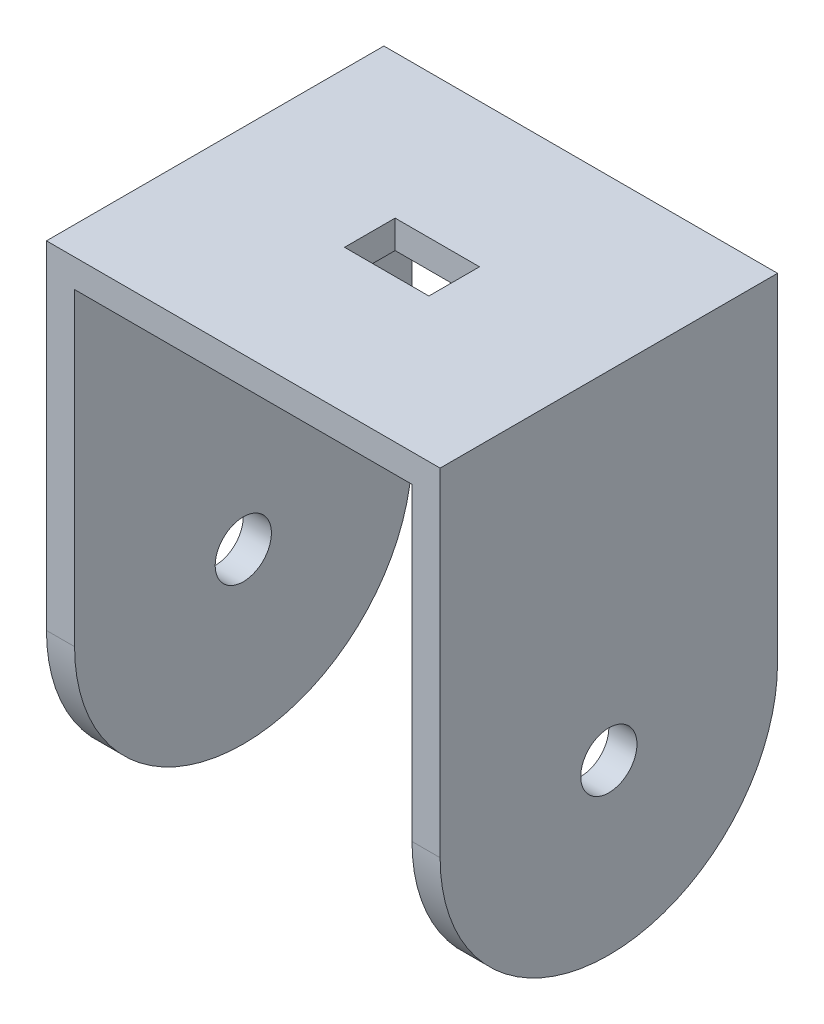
ISO-10303-21;
HEADER;
FILE_DESCRIPTION(('STEP AP214'),'2;1');
FILE_NAME('part.step','',(''),(''),'','','');
FILE_SCHEMA(('AUTOMOTIVE_DESIGN { 1 0 10303 214 1 1 1 1 }'));
ENDSEC;
DATA;
#1=APPLICATION_CONTEXT('core data for automotive mechanical design processes');
#2=APPLICATION_PROTOCOL_DEFINITION('international standard','automotive_design',2000,#1);
#3=PRODUCT_CONTEXT('',#1,'mechanical');
#4=PRODUCT('Part','Part','',(#3));
#5=PRODUCT_RELATED_PRODUCT_CATEGORY('part','',(#4));
#6=PRODUCT_DEFINITION_FORMATION('','',#4);
#7=PRODUCT_DEFINITION_CONTEXT('part definition',#1,'design');
#8=PRODUCT_DEFINITION('design','',#6,#7);
#9=PRODUCT_DEFINITION_SHAPE('','',#8);
#10=(LENGTH_UNIT() NAMED_UNIT(*) SI_UNIT(.MILLI.,.METRE.));
#11=(NAMED_UNIT(*) PLANE_ANGLE_UNIT() SI_UNIT($,.RADIAN.));
#12=(NAMED_UNIT(*) SI_UNIT($,.STERADIAN.) SOLID_ANGLE_UNIT());
#13=UNCERTAINTY_MEASURE_WITH_UNIT(LENGTH_MEASURE(1.E-05),#10,'distance_accuracy_value','');
#14=(GEOMETRIC_REPRESENTATION_CONTEXT(3) GLOBAL_UNCERTAINTY_ASSIGNED_CONTEXT((#13)) GLOBAL_UNIT_ASSIGNED_CONTEXT((#10,
#11,#12)) REPRESENTATION_CONTEXT('',''));
#15=CARTESIAN_POINT('',(0.,0.,0.));
#16=DIRECTION('',(0.,0.,1.));
#17=DIRECTION('',(1.,0.,0.));
#18=AXIS2_PLACEMENT_3D('',#15,#16,#17);
#19=CARTESIAN_POINT('',(0.,-5.,0.));
#20=DIRECTION('',(0.,1.,0.));
#21=DIRECTION('',(0.,0.,1.));
#22=AXIS2_PLACEMENT_3D('',#19,#20,#21);
#23=PLANE('',#22);
#24=DIRECTION('',(1.,0.,0.));
#25=VECTOR('',#24,1.);
#26=CARTESIAN_POINT('',(0.,-5.,4.5));
#27=LINE('',#26,#25);
#28=CARTESIAN_POINT('',(-7.5,-5.,4.5));
#29=VERTEX_POINT('',#28);
#30=CARTESIAN_POINT('',(7.5,-5.,4.5));
#31=VERTEX_POINT('',#30);
#32=EDGE_CURVE('E155',#29,#31,#27,.T.);
#33=ORIENTED_EDGE('',*,*,#32,.T.);
#34=DIRECTION('',(0.,0.,-1.));
#35=VECTOR('',#34,1.);
#36=CARTESIAN_POINT('',(7.5,-5.,0.));
#37=LINE('',#36,#35);
#38=CARTESIAN_POINT('',(7.5,-5.,-4.5));
#39=VERTEX_POINT('',#38);
#40=EDGE_CURVE('E158',#31,#39,#37,.T.);
#41=ORIENTED_EDGE('',*,*,#40,.T.);
#42=DIRECTION('',(-1.,0.,0.));
#43=VECTOR('',#42,1.);
#44=CARTESIAN_POINT('',(0.,-5.,-4.5));
#45=LINE('',#44,#43);
#46=CARTESIAN_POINT('',(-7.5,-5.,-4.5));
#47=VERTEX_POINT('',#46);
#48=EDGE_CURVE('E150',#39,#47,#45,.T.);
#49=ORIENTED_EDGE('',*,*,#48,.T.);
#50=DIRECTION('',(0.,0.,1.));
#51=VECTOR('',#50,1.);
#52=CARTESIAN_POINT('',(-7.5,-5.,0.));
#53=LINE('',#52,#51);
#54=EDGE_CURVE('E130',#47,#29,#53,.T.);
#55=ORIENTED_EDGE('',*,*,#54,.T.);
#56=EDGE_LOOP('',(#33,#41,#49,#55));
#57=FACE_BOUND('',#56,.T.);
#58=DIRECTION('',(0.,0.,1.));
#59=VECTOR('',#58,1.);
#60=CARTESIAN_POINT('',(-30.,-5.,0.));
#61=LINE('',#60,#59);
#62=CARTESIAN_POINT('',(-30.,-5.,-30.));
#63=VERTEX_POINT('',#62);
#64=CARTESIAN_POINT('',(-30.,-5.,30.));
#65=VERTEX_POINT('',#64);
#66=EDGE_CURVE('E183',#63,#65,#61,.T.);
#67=ORIENTED_EDGE('',*,*,#66,.F.);
#68=DIRECTION('',(-1.,0.,0.));
#69=VECTOR('',#68,1.);
#70=CARTESIAN_POINT('',(-35.,-5.,-30.));
#71=LINE('',#70,#69);
#72=CARTESIAN_POINT('',(30.,-5.,-30.));
#73=VERTEX_POINT('',#72);
#74=EDGE_CURVE('E207',#73,#63,#71,.T.);
#75=ORIENTED_EDGE('',*,*,#74,.F.);
#76=DIRECTION('',(0.,0.,-1.));
#77=VECTOR('',#76,1.);
#78=CARTESIAN_POINT('',(30.,-5.,0.));
#79=LINE('',#78,#77);
#80=CARTESIAN_POINT('',(30.,-5.,30.));
#81=VERTEX_POINT('',#80);
#82=EDGE_CURVE('E202',#81,#73,#79,.T.);
#83=ORIENTED_EDGE('',*,*,#82,.F.);
#84=DIRECTION('',(1.,0.,0.));
#85=VECTOR('',#84,1.);
#86=CARTESIAN_POINT('',(-35.,-5.,30.));
#87=LINE('',#86,#85);
#88=EDGE_CURVE('E210',#65,#81,#87,.T.);
#89=ORIENTED_EDGE('',*,*,#88,.F.);
#90=EDGE_LOOP('',(#67,#75,#83,#89));
#91=FACE_BOUND('',#90,.T.);
#92=ADVANCED_FACE('F33',(#57,#91),#23,.F.);
#93=CARTESIAN_POINT('',(35.,-5.,-30.));
#94=DIRECTION('',(1.,0.,0.));
#95=DIRECTION('',(0.,0.,-1.));
#96=AXIS2_PLACEMENT_3D('',#93,#94,#95);
#97=PLANE('',#96);
#98=CARTESIAN_POINT('',(35.,-60.,0.));
#99=DIRECTION('',(1.,0.,0.));
#100=DIRECTION('',(0.,0.,-1.));
#101=AXIS2_PLACEMENT_3D('',#98,#99,#100);
#102=CIRCLE('',#101,5.);
#103=CARTESIAN_POINT('',(35.,-60.,-5.00000000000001));
#104=VERTEX_POINT('',#103);
#105=EDGE_CURVE('E161',#104,#104,#102,.T.);
#106=ORIENTED_EDGE('',*,*,#105,.F.);
#107=EDGE_LOOP('',(#106));
#108=FACE_BOUND('',#107,.T.);
#109=DIRECTION('',(0.,0.,-1.));
#110=VECTOR('',#109,1.);
#111=CARTESIAN_POINT('',(35.,0.,-30.));
#112=LINE('',#111,#110);
#113=CARTESIAN_POINT('',(35.,0.,30.));
#114=VERTEX_POINT('',#113);
#115=CARTESIAN_POINT('',(35.,0.,-30.));
#116=VERTEX_POINT('',#115);
#117=EDGE_CURVE('E206',#114,#116,#112,.T.);
#118=ORIENTED_EDGE('',*,*,#117,.F.);
#119=DIRECTION('',(0.,1.,0.));
#120=VECTOR('',#119,1.);
#121=CARTESIAN_POINT('',(35.,-5.,30.));
#122=LINE('',#121,#120);
#123=CARTESIAN_POINT('',(35.,-60.,30.));
#124=VERTEX_POINT('',#123);
#125=EDGE_CURVE('E11',#124,#114,#122,.T.);
#126=ORIENTED_EDGE('',*,*,#125,.F.);
#127=CARTESIAN_POINT('',(35.,-60.,0.));
#128=DIRECTION('',(1.,0.,0.));
#129=DIRECTION('',(0.,0.,-1.));
#130=AXIS2_PLACEMENT_3D('',#127,#128,#129);
#131=CIRCLE('',#130,30.);
#132=CARTESIAN_POINT('',(35.,-60.,-30.));
#133=VERTEX_POINT('',#132);
#134=EDGE_CURVE('E187',#124,#133,#131,.T.);
#135=ORIENTED_EDGE('',*,*,#134,.T.);
#136=DIRECTION('',(0.,1.,0.));
#137=VECTOR('',#136,1.);
#138=CARTESIAN_POINT('',(35.,-5.,-30.));
#139=LINE('',#138,#137);
#140=EDGE_CURVE('E213',#133,#116,#139,.T.);
#141=ORIENTED_EDGE('',*,*,#140,.T.);
#142=EDGE_LOOP('',(#118,#126,#135,#141));
#143=FACE_BOUND('',#142,.T.);
#144=ADVANCED_FACE('F35',(#108,#143),#97,.T.);
#145=CARTESIAN_POINT('',(-35.,-5.,30.));
#146=DIRECTION('',(0.,0.,1.));
#147=DIRECTION('',(1.,0.,0.));
#148=AXIS2_PLACEMENT_3D('',#145,#146,#147);
#149=PLANE('',#148);
#150=DIRECTION('',(0.,1.,0.));
#151=VECTOR('',#150,1.);
#152=CARTESIAN_POINT('',(-35.,-5.,30.));
#153=LINE('',#152,#151);
#154=CARTESIAN_POINT('',(-35.,-60.,30.));
#155=VERTEX_POINT('',#154);
#156=CARTESIAN_POINT('',(-35.,0.,30.));
#157=VERTEX_POINT('',#156);
#158=EDGE_CURVE('E42',#155,#157,#153,.T.);
#159=ORIENTED_EDGE('',*,*,#158,.F.);
#160=DIRECTION('',(-1.,0.,0.));
#161=VECTOR('',#160,1.);
#162=CARTESIAN_POINT('',(-30.,-60.,30.));
#163=LINE('',#162,#161);
#164=CARTESIAN_POINT('',(-30.,-60.,30.));
#165=VERTEX_POINT('',#164);
#166=EDGE_CURVE('E180',#165,#155,#163,.T.);
#167=ORIENTED_EDGE('',*,*,#166,.F.);
#168=DIRECTION('',(0.,-1.,0.));
#169=VECTOR('',#168,1.);
#170=CARTESIAN_POINT('',(-30.,0.,30.));
#171=LINE('',#170,#169);
#172=EDGE_CURVE('E175',#65,#165,#171,.T.);
#173=ORIENTED_EDGE('',*,*,#172,.F.);
#174=ORIENTED_EDGE('',*,*,#88,.T.);
#175=DIRECTION('',(0.,-1.,0.));
#176=VECTOR('',#175,1.);
#177=CARTESIAN_POINT('',(30.,0.,30.));
#178=LINE('',#177,#176);
#179=CARTESIAN_POINT('',(30.,-60.,30.));
#180=VERTEX_POINT('',#179);
#181=EDGE_CURVE('E188',#81,#180,#178,.T.);
#182=ORIENTED_EDGE('',*,*,#181,.T.);
#183=DIRECTION('',(1.,0.,0.));
#184=VECTOR('',#183,1.);
#185=CARTESIAN_POINT('',(30.,-60.,30.));
#186=LINE('',#185,#184);
#187=EDGE_CURVE('E196',#180,#124,#186,.T.);
#188=ORIENTED_EDGE('',*,*,#187,.T.);
#189=ORIENTED_EDGE('',*,*,#125,.T.);
#190=DIRECTION('',(1.,0.,0.));
#191=VECTOR('',#190,1.);
#192=CARTESIAN_POINT('',(-35.,0.,30.));
#193=LINE('',#192,#191);
#194=EDGE_CURVE('E211',#157,#114,#193,.T.);
#195=ORIENTED_EDGE('',*,*,#194,.F.);
#196=EDGE_LOOP('',(#159,#167,#173,#174,#182,#188,#189,#195));
#197=FACE_BOUND('',#196,.T.);
#198=ADVANCED_FACE('F234',(#197),#149,.T.);
#199=CARTESIAN_POINT('',(-35.,-5.,-30.));
#200=DIRECTION('',(-1.,0.,0.));
#201=DIRECTION('',(0.,0.,1.));
#202=AXIS2_PLACEMENT_3D('',#199,#200,#201);
#203=PLANE('',#202);
#204=CARTESIAN_POINT('',(-35.,-60.,0.));
#205=DIRECTION('',(1.,0.,0.));
#206=DIRECTION('',(0.,0.,-1.));
#207=AXIS2_PLACEMENT_3D('',#204,#205,#206);
#208=CIRCLE('',#207,5.);
#209=CARTESIAN_POINT('',(-35.,-60.,-4.99999999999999));
#210=VERTEX_POINT('',#209);
#211=EDGE_CURVE('E162',#210,#210,#208,.T.);
#212=ORIENTED_EDGE('',*,*,#211,.T.);
#213=EDGE_LOOP('',(#212));
#214=FACE_BOUND('',#213,.T.);
#215=DIRECTION('',(0.,0.,1.));
#216=VECTOR('',#215,1.);
#217=CARTESIAN_POINT('',(-35.,0.,-30.));
#218=LINE('',#217,#216);
#219=CARTESIAN_POINT('',(-35.,0.,-30.));
#220=VERTEX_POINT('',#219);
#221=EDGE_CURVE('E218',#220,#157,#218,.T.);
#222=ORIENTED_EDGE('',*,*,#221,.F.);
#223=DIRECTION('',(0.,1.,0.));
#224=VECTOR('',#223,1.);
#225=CARTESIAN_POINT('',(-35.,-5.,-30.));
#226=LINE('',#225,#224);
#227=CARTESIAN_POINT('',(-35.,-60.,-30.));
#228=VERTEX_POINT('',#227);
#229=EDGE_CURVE('E223',#228,#220,#226,.T.);
#230=ORIENTED_EDGE('',*,*,#229,.F.);
#231=CARTESIAN_POINT('',(-35.,-60.,0.));
#232=DIRECTION('',(1.,0.,0.));
#233=DIRECTION('',(0.,0.,-1.));
#234=AXIS2_PLACEMENT_3D('',#231,#232,#233);
#235=CIRCLE('',#234,30.);
#236=EDGE_CURVE('E170',#155,#228,#235,.T.);
#237=ORIENTED_EDGE('',*,*,#236,.F.);
#238=ORIENTED_EDGE('',*,*,#158,.T.);
#239=EDGE_LOOP('',(#222,#230,#237,#238));
#240=FACE_BOUND('',#239,.T.);
#241=ADVANCED_FACE('F258',(#214,#240),#203,.T.);
#242=CARTESIAN_POINT('',(-35.,-5.,-30.));
#243=DIRECTION('',(0.,0.,-1.));
#244=DIRECTION('',(-1.,0.,0.));
#245=AXIS2_PLACEMENT_3D('',#242,#243,#244);
#246=PLANE('',#245);
#247=ORIENTED_EDGE('',*,*,#229,.T.);
#248=DIRECTION('',(-1.,0.,0.));
#249=VECTOR('',#248,1.);
#250=CARTESIAN_POINT('',(-35.,0.,-30.));
#251=LINE('',#250,#249);
#252=EDGE_CURVE('E216',#116,#220,#251,.T.);
#253=ORIENTED_EDGE('',*,*,#252,.F.);
#254=ORIENTED_EDGE('',*,*,#140,.F.);
#255=DIRECTION('',(1.,0.,0.));
#256=VECTOR('',#255,1.);
#257=CARTESIAN_POINT('',(30.,-60.,-30.));
#258=LINE('',#257,#256);
#259=CARTESIAN_POINT('',(30.,-60.,-30.));
#260=VERTEX_POINT('',#259);
#261=EDGE_CURVE('E199',#260,#133,#258,.T.);
#262=ORIENTED_EDGE('',*,*,#261,.F.);
#263=DIRECTION('',(0.,1.,0.));
#264=VECTOR('',#263,1.);
#265=CARTESIAN_POINT('',(30.,0.,-30.));
#266=LINE('',#265,#264);
#267=EDGE_CURVE('E193',#260,#73,#266,.T.);
#268=ORIENTED_EDGE('',*,*,#267,.T.);
#269=ORIENTED_EDGE('',*,*,#74,.T.);
#270=DIRECTION('',(0.,1.,0.));
#271=VECTOR('',#270,1.);
#272=CARTESIAN_POINT('',(-30.,0.,-30.));
#273=LINE('',#272,#271);
#274=CARTESIAN_POINT('',(-30.,-60.,-30.));
#275=VERTEX_POINT('',#274);
#276=EDGE_CURVE('E171',#275,#63,#273,.T.);
#277=ORIENTED_EDGE('',*,*,#276,.F.);
#278=DIRECTION('',(-1.,0.,0.));
#279=VECTOR('',#278,1.);
#280=CARTESIAN_POINT('',(-30.,-60.,-30.));
#281=LINE('',#280,#279);
#282=EDGE_CURVE('E177',#275,#228,#281,.T.);
#283=ORIENTED_EDGE('',*,*,#282,.T.);
#284=EDGE_LOOP('',(#247,#253,#254,#262,#268,#269,#277,#283));
#285=FACE_BOUND('',#284,.T.);
#286=ADVANCED_FACE('F230',(#285),#246,.T.);
#287=CARTESIAN_POINT('',(0.,0.,0.));
#288=DIRECTION('',(0.,1.,0.));
#289=DIRECTION('',(0.,0.,1.));
#290=AXIS2_PLACEMENT_3D('',#287,#288,#289);
#291=PLANE('',#290);
#292=DIRECTION('',(0.,0.,-1.));
#293=VECTOR('',#292,1.);
#294=CARTESIAN_POINT('',(7.5,0.,-4.5));
#295=LINE('',#294,#293);
#296=CARTESIAN_POINT('',(7.5,0.,4.5));
#297=VERTEX_POINT('',#296);
#298=CARTESIAN_POINT('',(7.5,0.,-4.5));
#299=VERTEX_POINT('',#298);
#300=EDGE_CURVE('E58',#297,#299,#295,.T.);
#301=ORIENTED_EDGE('',*,*,#300,.F.);
#302=DIRECTION('',(1.,0.,0.));
#303=VECTOR('',#302,1.);
#304=CARTESIAN_POINT('',(-7.5,0.,4.5));
#305=LINE('',#304,#303);
#306=CARTESIAN_POINT('',(-7.5,0.,4.5));
#307=VERTEX_POINT('',#306);
#308=EDGE_CURVE('E143',#307,#297,#305,.T.);
#309=ORIENTED_EDGE('',*,*,#308,.F.);
#310=DIRECTION('',(0.,0.,1.));
#311=VECTOR('',#310,1.);
#312=CARTESIAN_POINT('',(-7.5,0.,-4.5));
#313=LINE('',#312,#311);
#314=CARTESIAN_POINT('',(-7.5,0.,-4.5));
#315=VERTEX_POINT('',#314);
#316=EDGE_CURVE('E127',#315,#307,#313,.T.);
#317=ORIENTED_EDGE('',*,*,#316,.F.);
#318=DIRECTION('',(-1.,0.,0.));
#319=VECTOR('',#318,1.);
#320=CARTESIAN_POINT('',(-7.5,0.,-4.5));
#321=LINE('',#320,#319);
#322=EDGE_CURVE('E136',#299,#315,#321,.T.);
#323=ORIENTED_EDGE('',*,*,#322,.F.);
#324=EDGE_LOOP('',(#301,#309,#317,#323));
#325=FACE_BOUND('',#324,.T.);
#326=ORIENTED_EDGE('',*,*,#194,.T.);
#327=ORIENTED_EDGE('',*,*,#117,.T.);
#328=ORIENTED_EDGE('',*,*,#252,.T.);
#329=ORIENTED_EDGE('',*,*,#221,.T.);
#330=EDGE_LOOP('',(#326,#327,#328,#329));
#331=FACE_BOUND('',#330,.T.);
#332=ADVANCED_FACE('F140',(#325,#331),#291,.T.);
#333=CARTESIAN_POINT('',(30.,-60.,0.));
#334=DIRECTION('',(1.,0.,0.));
#335=DIRECTION('',(0.,0.,-1.));
#336=AXIS2_PLACEMENT_3D('',#333,#334,#335);
#337=PLANE('',#336);
#338=CARTESIAN_POINT('',(30.,-60.,0.));
#339=DIRECTION('',(1.,0.,0.));
#340=DIRECTION('',(0.,0.,-1.));
#341=AXIS2_PLACEMENT_3D('',#338,#339,#340);
#342=CIRCLE('',#341,5.);
#343=CARTESIAN_POINT('',(30.,-60.,-5.00000000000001));
#344=VERTEX_POINT('',#343);
#345=EDGE_CURVE('E167',#344,#344,#342,.T.);
#346=ORIENTED_EDGE('',*,*,#345,.T.);
#347=EDGE_LOOP('',(#346));
#348=FACE_BOUND('',#347,.T.);
#349=ORIENTED_EDGE('',*,*,#181,.F.);
#350=ORIENTED_EDGE('',*,*,#82,.T.);
#351=ORIENTED_EDGE('',*,*,#267,.F.);
#352=CARTESIAN_POINT('',(30.,-60.,0.));
#353=DIRECTION('',(1.,0.,0.));
#354=DIRECTION('',(0.,0.,-1.));
#355=AXIS2_PLACEMENT_3D('',#352,#353,#354);
#356=CIRCLE('',#355,30.);
#357=EDGE_CURVE('E190',#180,#260,#356,.T.);
#358=ORIENTED_EDGE('',*,*,#357,.F.);
#359=EDGE_LOOP('',(#349,#350,#351,#358));
#360=FACE_BOUND('',#359,.T.);
#361=ADVANCED_FACE('F278',(#348,#360),#337,.F.);
#362=CARTESIAN_POINT('',(30.,-60.,0.));
#363=DIRECTION('',(1.,0.,0.));
#364=DIRECTION('',(0.,0.,-1.));
#365=AXIS2_PLACEMENT_3D('',#362,#363,#364);
#366=CYLINDRICAL_SURFACE('',#365,30.);
#367=ORIENTED_EDGE('',*,*,#134,.F.);
#368=ORIENTED_EDGE('',*,*,#187,.F.);
#369=ORIENTED_EDGE('',*,*,#357,.T.);
#370=ORIENTED_EDGE('',*,*,#261,.T.);
#371=EDGE_LOOP('',(#367,#368,#369,#370));
#372=FACE_BOUND('',#371,.T.);
#373=ADVANCED_FACE('F239',(#372),#366,.T.);
#374=CARTESIAN_POINT('',(-30.,-60.,0.));
#375=DIRECTION('',(-1.,0.,0.));
#376=DIRECTION('',(0.,0.,-1.));
#377=AXIS2_PLACEMENT_3D('',#374,#375,#376);
#378=PLANE('',#377);
#379=CARTESIAN_POINT('',(-30.,-60.,0.));
#380=DIRECTION('',(-1.,0.,0.));
#381=DIRECTION('',(0.,0.,1.));
#382=AXIS2_PLACEMENT_3D('',#379,#380,#381);
#383=CIRCLE('',#382,5.);
#384=CARTESIAN_POINT('',(-30.,-60.,5.00000000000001));
#385=VERTEX_POINT('',#384);
#386=EDGE_CURVE('E37',#385,#385,#383,.T.);
#387=ORIENTED_EDGE('',*,*,#386,.T.);
#388=EDGE_LOOP('',(#387));
#389=FACE_BOUND('',#388,.T.);
#390=ORIENTED_EDGE('',*,*,#276,.T.);
#391=ORIENTED_EDGE('',*,*,#66,.T.);
#392=ORIENTED_EDGE('',*,*,#172,.T.);
#393=CARTESIAN_POINT('',(-30.,-60.,0.));
#394=DIRECTION('',(1.,0.,0.));
#395=DIRECTION('',(0.,0.,-1.));
#396=AXIS2_PLACEMENT_3D('',#393,#394,#395);
#397=CIRCLE('',#396,30.);
#398=EDGE_CURVE('E173',#165,#275,#397,.T.);
#399=ORIENTED_EDGE('',*,*,#398,.T.);
#400=EDGE_LOOP('',(#390,#391,#392,#399));
#401=FACE_BOUND('',#400,.T.);
#402=ADVANCED_FACE('F250',(#389,#401),#378,.F.);
#403=CARTESIAN_POINT('',(-30.,-60.,0.));
#404=DIRECTION('',(-1.,0.,0.));
#405=DIRECTION('',(0.,0.,1.));
#406=AXIS2_PLACEMENT_3D('',#403,#404,#405);
#407=CYLINDRICAL_SURFACE('',#406,30.);
#408=ORIENTED_EDGE('',*,*,#236,.T.);
#409=ORIENTED_EDGE('',*,*,#282,.F.);
#410=ORIENTED_EDGE('',*,*,#398,.F.);
#411=ORIENTED_EDGE('',*,*,#166,.T.);
#412=EDGE_LOOP('',(#408,#409,#410,#411));
#413=FACE_BOUND('',#412,.T.);
#414=ADVANCED_FACE('F256',(#413),#407,.T.);
#415=CARTESIAN_POINT('',(-35.,-60.,0.));
#416=DIRECTION('',(1.,0.,0.));
#417=DIRECTION('',(0.,0.,-1.));
#418=AXIS2_PLACEMENT_3D('',#415,#416,#417);
#419=CYLINDRICAL_SURFACE('',#418,5.);
#420=ORIENTED_EDGE('',*,*,#211,.F.);
#421=EDGE_LOOP('',(#420));
#422=FACE_BOUND('',#421,.T.);
#423=ORIENTED_EDGE('',*,*,#386,.F.);
#424=EDGE_LOOP('',(#423));
#425=FACE_BOUND('',#424,.T.);
#426=ADVANCED_FACE('F289',(#422,#425),#419,.F.);
#427=ORIENTED_EDGE('',*,*,#105,.T.);
#428=EDGE_LOOP('',(#427));
#429=FACE_BOUND('',#428,.T.);
#430=ORIENTED_EDGE('',*,*,#345,.F.);
#431=EDGE_LOOP('',(#430));
#432=FACE_BOUND('',#431,.T.);
#433=ADVANCED_FACE('F293',(#429,#432),#419,.F.);
#434=CARTESIAN_POINT('',(7.5,-10.,-4.5));
#435=DIRECTION('',(1.,0.,0.));
#436=DIRECTION('',(0.,0.,-1.));
#437=AXIS2_PLACEMENT_3D('',#434,#435,#436);
#438=PLANE('',#437);
#439=DIRECTION('',(0.,1.,0.));
#440=VECTOR('',#439,1.);
#441=CARTESIAN_POINT('',(7.5,-10.,4.5));
#442=LINE('',#441,#440);
#443=EDGE_CURVE('E148',#31,#297,#442,.T.);
#444=ORIENTED_EDGE('',*,*,#443,.T.);
#445=ORIENTED_EDGE('',*,*,#300,.T.);
#446=DIRECTION('',(0.,1.,0.));
#447=VECTOR('',#446,1.);
#448=CARTESIAN_POINT('',(7.5,-10.,-4.5));
#449=LINE('',#448,#447);
#450=EDGE_CURVE('E133',#39,#299,#449,.T.);
#451=ORIENTED_EDGE('',*,*,#450,.F.);
#452=ORIENTED_EDGE('',*,*,#40,.F.);
#453=EDGE_LOOP('',(#444,#445,#451,#452));
#454=FACE_BOUND('',#453,.T.);
#455=ADVANCED_FACE('F296',(#454),#438,.F.);
#456=CARTESIAN_POINT('',(-7.5,-10.,4.5));
#457=DIRECTION('',(0.,0.,1.));
#458=DIRECTION('',(1.,0.,0.));
#459=AXIS2_PLACEMENT_3D('',#456,#457,#458);
#460=PLANE('',#459);
#461=DIRECTION('',(0.,1.,0.));
#462=VECTOR('',#461,1.);
#463=CARTESIAN_POINT('',(-7.5,-10.,4.5));
#464=LINE('',#463,#462);
#465=EDGE_CURVE('E132',#29,#307,#464,.T.);
#466=ORIENTED_EDGE('',*,*,#465,.T.);
#467=ORIENTED_EDGE('',*,*,#308,.T.);
#468=ORIENTED_EDGE('',*,*,#443,.F.);
#469=ORIENTED_EDGE('',*,*,#32,.F.);
#470=EDGE_LOOP('',(#466,#467,#468,#469));
#471=FACE_BOUND('',#470,.T.);
#472=ADVANCED_FACE('F300',(#471),#460,.F.);
#473=CARTESIAN_POINT('',(-7.5,-10.,-4.5));
#474=DIRECTION('',(-1.,0.,0.));
#475=DIRECTION('',(0.,0.,1.));
#476=AXIS2_PLACEMENT_3D('',#473,#474,#475);
#477=PLANE('',#476);
#478=DIRECTION('',(0.,1.,0.));
#479=VECTOR('',#478,1.);
#480=CARTESIAN_POINT('',(-7.5,-10.,-4.5));
#481=LINE('',#480,#479);
#482=EDGE_CURVE('E50',#47,#315,#481,.T.);
#483=ORIENTED_EDGE('',*,*,#482,.T.);
#484=ORIENTED_EDGE('',*,*,#316,.T.);
#485=ORIENTED_EDGE('',*,*,#465,.F.);
#486=ORIENTED_EDGE('',*,*,#54,.F.);
#487=EDGE_LOOP('',(#483,#484,#485,#486));
#488=FACE_BOUND('',#487,.T.);
#489=ADVANCED_FACE('F124',(#488),#477,.F.);
#490=CARTESIAN_POINT('',(-7.5,-10.,-4.5));
#491=DIRECTION('',(0.,0.,-1.));
#492=DIRECTION('',(-1.,0.,0.));
#493=AXIS2_PLACEMENT_3D('',#490,#491,#492);
#494=PLANE('',#493);
#495=ORIENTED_EDGE('',*,*,#450,.T.);
#496=ORIENTED_EDGE('',*,*,#322,.T.);
#497=ORIENTED_EDGE('',*,*,#482,.F.);
#498=ORIENTED_EDGE('',*,*,#48,.F.);
#499=EDGE_LOOP('',(#495,#496,#497,#498));
#500=FACE_BOUND('',#499,.T.);
#501=ADVANCED_FACE('F137',(#500),#494,.F.);
#502=CLOSED_SHELL('',(#92,#144,#198,#241,#286,#332,#361,#373,#402,#414,#426,#433,#455,#472,#489,#501));
#503=MANIFOLD_SOLID_BREP('B2',#502);
#504=ADVANCED_BREP_SHAPE_REPRESENTATION('',(#18,#503),#14);
#505=SHAPE_DEFINITION_REPRESENTATION(#9,#504);
ENDSEC;
END-ISO-10303-21;
